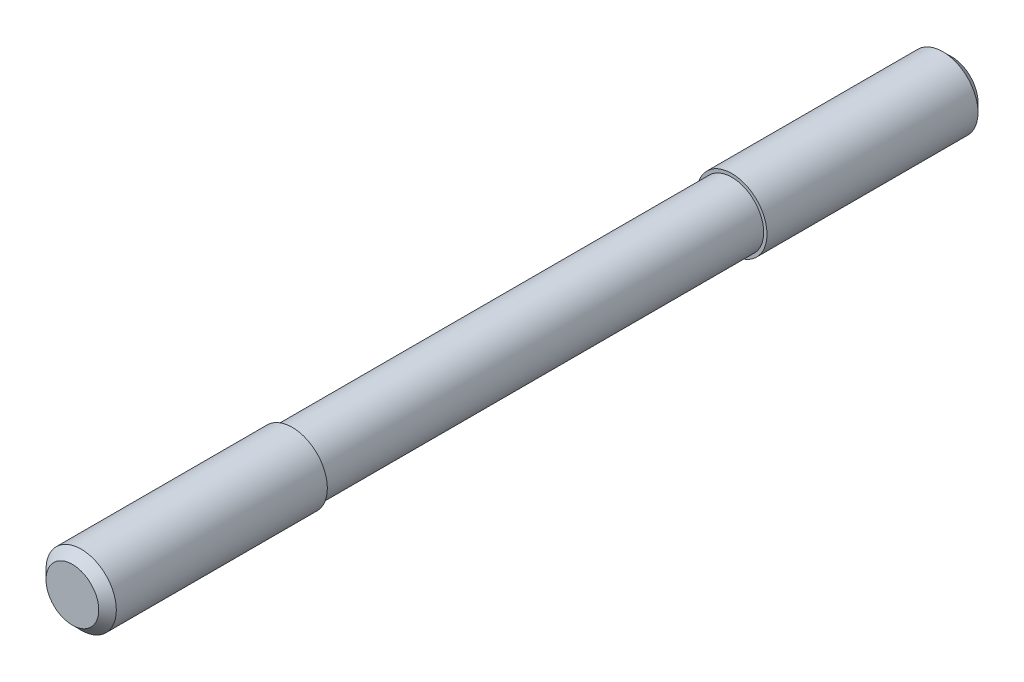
ISO-10303-21;
HEADER;
FILE_DESCRIPTION(('STEP AP214'),'2;1');
FILE_NAME('part.step','',(''),(''),'','','');
FILE_SCHEMA(('AUTOMOTIVE_DESIGN { 1 0 10303 214 1 1 1 1 }'));
ENDSEC;
DATA;
#1=APPLICATION_CONTEXT('core data for automotive mechanical design processes');
#2=APPLICATION_PROTOCOL_DEFINITION('international standard','automotive_design',2000,#1);
#3=PRODUCT_CONTEXT('',#1,'mechanical');
#4=PRODUCT('Part','Part','',(#3));
#5=PRODUCT_RELATED_PRODUCT_CATEGORY('part','',(#4));
#6=PRODUCT_DEFINITION_FORMATION('','',#4);
#7=PRODUCT_DEFINITION_CONTEXT('part definition',#1,'design');
#8=PRODUCT_DEFINITION('design','',#6,#7);
#9=PRODUCT_DEFINITION_SHAPE('','',#8);
#10=(LENGTH_UNIT() NAMED_UNIT(*) SI_UNIT(.MILLI.,.METRE.));
#11=(NAMED_UNIT(*) PLANE_ANGLE_UNIT() SI_UNIT($,.RADIAN.));
#12=(NAMED_UNIT(*) SI_UNIT($,.STERADIAN.) SOLID_ANGLE_UNIT());
#13=UNCERTAINTY_MEASURE_WITH_UNIT(LENGTH_MEASURE(1.E-05),#10,'distance_accuracy_value','');
#14=(GEOMETRIC_REPRESENTATION_CONTEXT(3) GLOBAL_UNCERTAINTY_ASSIGNED_CONTEXT((#13)) GLOBAL_UNIT_ASSIGNED_CONTEXT((#10,
#11,#12)) REPRESENTATION_CONTEXT('',''));
#15=CARTESIAN_POINT('',(0.,0.,0.));
#16=DIRECTION('',(0.,0.,1.));
#17=DIRECTION('',(1.,0.,0.));
#18=AXIS2_PLACEMENT_3D('',#15,#16,#17);
#19=CARTESIAN_POINT('',(0.,0.,0.));
#20=DIRECTION('',(0.,0.,1.));
#21=DIRECTION('',(1.,0.,0.));
#22=AXIS2_PLACEMENT_3D('',#19,#20,#21);
#23=PLANE('',#22);
#24=CARTESIAN_POINT('',(0.,0.,0.));
#25=DIRECTION('',(0.,0.,1.));
#26=DIRECTION('',(1.,0.,0.));
#27=AXIS2_PLACEMENT_3D('',#24,#25,#26);
#28=CIRCLE('',#27,6.);
#29=CARTESIAN_POINT('',(6.,0.,0.));
#30=VERTEX_POINT('',#29);
#31=EDGE_CURVE('E8',#30,#30,#28,.T.);
#32=ORIENTED_EDGE('',*,*,#31,.F.);
#33=EDGE_LOOP('',(#32));
#34=FACE_BOUND('',#33,.T.);
#35=ADVANCED_FACE('F12',(#34),#23,.F.);
#36=CARTESIAN_POINT('',(0.,0.,2.));
#37=DIRECTION('',(0.,0.,1.));
#38=DIRECTION('',(1.,0.,0.));
#39=AXIS2_PLACEMENT_3D('',#36,#37,#38);
#40=CONICAL_SURFACE('',#39,8.,0.785398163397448);
#41=ORIENTED_EDGE('',*,*,#31,.T.);
#42=EDGE_LOOP('',(#41));
#43=FACE_BOUND('',#42,.T.);
#44=CARTESIAN_POINT('',(0.,0.,2.));
#45=DIRECTION('',(0.,0.,1.));
#46=DIRECTION('',(1.,0.,0.));
#47=AXIS2_PLACEMENT_3D('',#44,#45,#46);
#48=CIRCLE('',#47,8.);
#49=CARTESIAN_POINT('',(8.,0.,2.));
#50=VERTEX_POINT('',#49);
#51=EDGE_CURVE('E18',#50,#50,#48,.T.);
#52=ORIENTED_EDGE('',*,*,#51,.F.);
#53=EDGE_LOOP('',(#52));
#54=FACE_BOUND('',#53,.T.);
#55=ADVANCED_FACE('F62',(#43,#54),#40,.T.);
#56=CARTESIAN_POINT('',(0.,0.,70.));
#57=DIRECTION('',(0.,0.,1.));
#58=DIRECTION('',(1.,0.,0.));
#59=AXIS2_PLACEMENT_3D('',#56,#57,#58);
#60=CYLINDRICAL_SURFACE('',#59,8.);
#61=CARTESIAN_POINT('',(0.,0.,50.));
#62=DIRECTION('',(0.,0.,1.));
#63=DIRECTION('',(1.,0.,0.));
#64=AXIS2_PLACEMENT_3D('',#61,#62,#63);
#65=CIRCLE('',#64,8.);
#66=CARTESIAN_POINT('',(8.,0.,50.));
#67=VERTEX_POINT('',#66);
#68=EDGE_CURVE('E22',#67,#67,#65,.T.);
#69=ORIENTED_EDGE('',*,*,#68,.F.);
#70=EDGE_LOOP('',(#69));
#71=FACE_BOUND('',#70,.T.);
#72=ORIENTED_EDGE('',*,*,#51,.T.);
#73=EDGE_LOOP('',(#72));
#74=FACE_BOUND('',#73,.T.);
#75=ADVANCED_FACE('F68',(#71,#74),#60,.T.);
#76=CARTESIAN_POINT('',(8.,0.,50.));
#77=DIRECTION('',(0.,0.,-1.));
#78=DIRECTION('',(-1.,0.,0.));
#79=AXIS2_PLACEMENT_3D('',#76,#77,#78);
#80=PLANE('',#79);
#81=CARTESIAN_POINT('',(0.,0.,50.));
#82=DIRECTION('',(0.,0.,1.));
#83=DIRECTION('',(1.,0.,0.));
#84=AXIS2_PLACEMENT_3D('',#81,#82,#83);
#85=CIRCLE('',#84,7.25);
#86=CARTESIAN_POINT('',(7.25,0.,50.));
#87=VERTEX_POINT('',#86);
#88=EDGE_CURVE('E26',#87,#87,#85,.T.);
#89=ORIENTED_EDGE('',*,*,#88,.F.);
#90=EDGE_LOOP('',(#89));
#91=FACE_BOUND('',#90,.T.);
#92=ORIENTED_EDGE('',*,*,#68,.T.);
#93=EDGE_LOOP('',(#92));
#94=FACE_BOUND('',#93,.T.);
#95=ADVANCED_FACE('F73',(#91,#94),#80,.F.);
#96=CARTESIAN_POINT('',(0.,0.,70.));
#97=DIRECTION('',(0.,0.,1.));
#98=DIRECTION('',(1.,0.,0.));
#99=AXIS2_PLACEMENT_3D('',#96,#97,#98);
#100=CYLINDRICAL_SURFACE('',#99,7.25);
#101=CARTESIAN_POINT('',(0.,0.,150.));
#102=DIRECTION('',(0.,0.,1.));
#103=DIRECTION('',(1.,0.,0.));
#104=AXIS2_PLACEMENT_3D('',#101,#102,#103);
#105=CIRCLE('',#104,7.25);
#106=CARTESIAN_POINT('',(7.25,0.,150.));
#107=VERTEX_POINT('',#106);
#108=EDGE_CURVE('E31',#107,#107,#105,.T.);
#109=ORIENTED_EDGE('',*,*,#108,.F.);
#110=EDGE_LOOP('',(#109));
#111=FACE_BOUND('',#110,.T.);
#112=ORIENTED_EDGE('',*,*,#88,.T.);
#113=EDGE_LOOP('',(#112));
#114=FACE_BOUND('',#113,.T.);
#115=ADVANCED_FACE('F80',(#111,#114),#100,.T.);
#116=CARTESIAN_POINT('',(7.25,0.,150.));
#117=DIRECTION('',(0.,0.,1.));
#118=DIRECTION('',(1.,0.,0.));
#119=AXIS2_PLACEMENT_3D('',#116,#117,#118);
#120=PLANE('',#119);
#121=CARTESIAN_POINT('',(0.,0.,150.));
#122=DIRECTION('',(0.,0.,1.));
#123=DIRECTION('',(1.,0.,0.));
#124=AXIS2_PLACEMENT_3D('',#121,#122,#123);
#125=CIRCLE('',#124,8.);
#126=CARTESIAN_POINT('',(8.,0.,150.));
#127=VERTEX_POINT('',#126);
#128=EDGE_CURVE('E34',#127,#127,#125,.T.);
#129=ORIENTED_EDGE('',*,*,#128,.F.);
#130=EDGE_LOOP('',(#129));
#131=FACE_BOUND('',#130,.T.);
#132=ORIENTED_EDGE('',*,*,#108,.T.);
#133=EDGE_LOOP('',(#132));
#134=FACE_BOUND('',#133,.T.);
#135=ADVANCED_FACE('F58',(#131,#134),#120,.F.);
#136=CARTESIAN_POINT('',(0.,0.,70.));
#137=DIRECTION('',(0.,0.,1.));
#138=DIRECTION('',(1.,0.,0.));
#139=AXIS2_PLACEMENT_3D('',#136,#137,#138);
#140=CYLINDRICAL_SURFACE('',#139,8.);
#141=CARTESIAN_POINT('',(0.,0.,198.));
#142=DIRECTION('',(0.,0.,1.));
#143=DIRECTION('',(1.,0.,0.));
#144=AXIS2_PLACEMENT_3D('',#141,#142,#143);
#145=CIRCLE('',#144,8.);
#146=CARTESIAN_POINT('',(8.,0.,198.));
#147=VERTEX_POINT('',#146);
#148=EDGE_CURVE('E37',#147,#147,#145,.T.);
#149=ORIENTED_EDGE('',*,*,#148,.F.);
#150=EDGE_LOOP('',(#149));
#151=FACE_BOUND('',#150,.T.);
#152=ORIENTED_EDGE('',*,*,#128,.T.);
#153=EDGE_LOOP('',(#152));
#154=FACE_BOUND('',#153,.T.);
#155=ADVANCED_FACE('F48',(#151,#154),#140,.T.);
#156=CARTESIAN_POINT('',(0.,0.,200.));
#157=DIRECTION('',(0.,0.,-1.));
#158=DIRECTION('',(-1.,0.,0.));
#159=AXIS2_PLACEMENT_3D('',#156,#157,#158);
#160=CONICAL_SURFACE('',#159,6.,0.785398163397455);
#161=ORIENTED_EDGE('',*,*,#148,.T.);
#162=EDGE_LOOP('',(#161));
#163=FACE_BOUND('',#162,.T.);
#164=CARTESIAN_POINT('',(0.,0.,200.));
#165=DIRECTION('',(0.,0.,1.));
#166=DIRECTION('',(1.,0.,0.));
#167=AXIS2_PLACEMENT_3D('',#164,#165,#166);
#168=CIRCLE('',#167,6.);
#169=CARTESIAN_POINT('',(6.,0.,200.));
#170=VERTEX_POINT('',#169);
#171=EDGE_CURVE('E40',#170,#170,#168,.T.);
#172=ORIENTED_EDGE('',*,*,#171,.F.);
#173=EDGE_LOOP('',(#172));
#174=FACE_BOUND('',#173,.T.);
#175=ADVANCED_FACE('F46',(#163,#174),#160,.T.);
#176=CARTESIAN_POINT('',(6.,0.,200.));
#177=DIRECTION('',(0.,0.,-1.));
#178=DIRECTION('',(-1.,0.,0.));
#179=AXIS2_PLACEMENT_3D('',#176,#177,#178);
#180=PLANE('',#179);
#181=ORIENTED_EDGE('',*,*,#171,.T.);
#182=EDGE_LOOP('',(#181));
#183=FACE_BOUND('',#182,.T.);
#184=ADVANCED_FACE('F44',(#183),#180,.F.);
#185=CLOSED_SHELL('',(#35,#55,#75,#95,#115,#135,#155,#175,#184));
#186=MANIFOLD_SOLID_BREP('B1',#185);
#187=ADVANCED_BREP_SHAPE_REPRESENTATION('',(#18,#186),#14);
#188=SHAPE_DEFINITION_REPRESENTATION(#9,#187);
ENDSEC;
END-ISO-10303-21;
